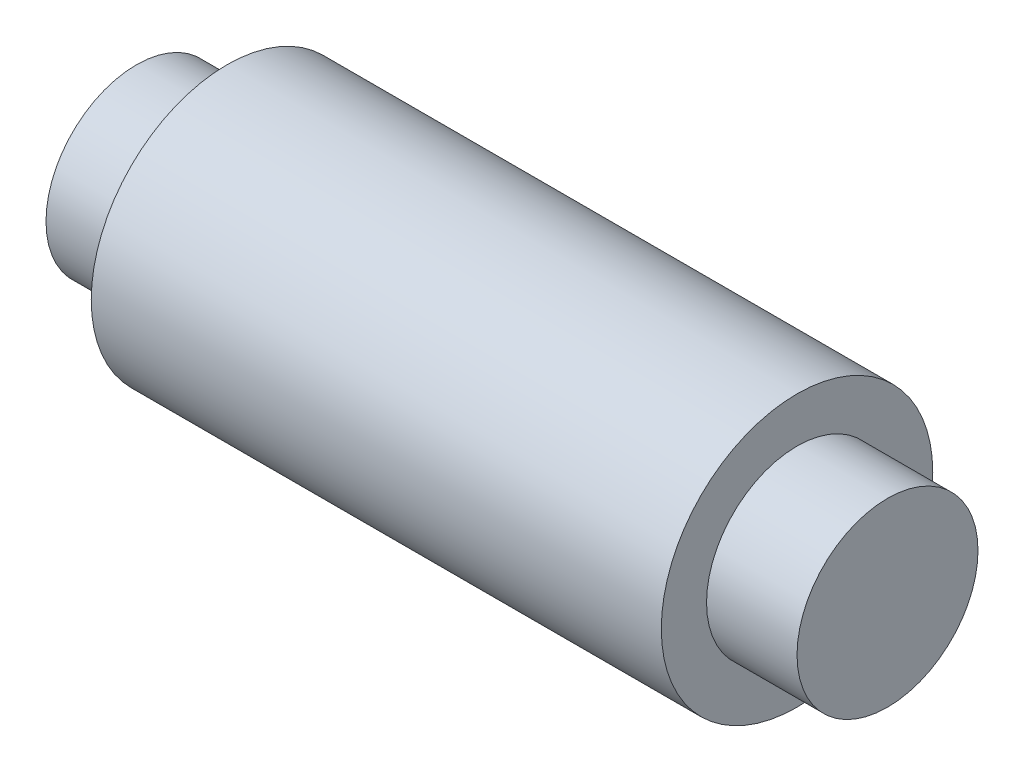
ISO-10303-21;
HEADER;
FILE_DESCRIPTION(('STEP AP214'),'2;1');
FILE_NAME('part.step','',(''),(''),'','','');
FILE_SCHEMA(('AUTOMOTIVE_DESIGN { 1 0 10303 214 1 1 1 1 }'));
ENDSEC;
DATA;
#1=APPLICATION_CONTEXT('core data for automotive mechanical design processes');
#2=APPLICATION_PROTOCOL_DEFINITION('international standard','automotive_design',2000,#1);
#3=PRODUCT_CONTEXT('',#1,'mechanical');
#4=PRODUCT('Part','Part','',(#3));
#5=PRODUCT_RELATED_PRODUCT_CATEGORY('part','',(#4));
#6=PRODUCT_DEFINITION_FORMATION('','',#4);
#7=PRODUCT_DEFINITION_CONTEXT('part definition',#1,'design');
#8=PRODUCT_DEFINITION('design','',#6,#7);
#9=PRODUCT_DEFINITION_SHAPE('','',#8);
#10=(LENGTH_UNIT() NAMED_UNIT(*) SI_UNIT(.MILLI.,.METRE.));
#11=(NAMED_UNIT(*) PLANE_ANGLE_UNIT() SI_UNIT($,.RADIAN.));
#12=(NAMED_UNIT(*) SI_UNIT($,.STERADIAN.) SOLID_ANGLE_UNIT());
#13=UNCERTAINTY_MEASURE_WITH_UNIT(LENGTH_MEASURE(1.E-05),#10,'distance_accuracy_value','');
#14=(GEOMETRIC_REPRESENTATION_CONTEXT(3) GLOBAL_UNCERTAINTY_ASSIGNED_CONTEXT((#13)) GLOBAL_UNIT_ASSIGNED_CONTEXT((#10,
#11,#12)) REPRESENTATION_CONTEXT('',''));
#15=CARTESIAN_POINT('',(0.,0.,0.));
#16=DIRECTION('',(0.,0.,1.));
#17=DIRECTION('',(1.,0.,0.));
#18=AXIS2_PLACEMENT_3D('',#15,#16,#17);
#19=CARTESIAN_POINT('',(0.,0.,0.));
#20=DIRECTION('',(1.,0.,0.));
#21=DIRECTION('',(0.,0.,-1.));
#22=AXIS2_PLACEMENT_3D('',#19,#20,#21);
#23=PLANE('',#22);
#24=CARTESIAN_POINT('',(0.,0.,0.));
#25=DIRECTION('',(-1.,0.,0.));
#26=DIRECTION('',(0.,0.,1.));
#27=AXIS2_PLACEMENT_3D('',#24,#25,#26);
#28=CIRCLE('',#27,10.);
#29=CARTESIAN_POINT('',(0.,0.,10.));
#30=VERTEX_POINT('',#29);
#31=EDGE_CURVE('E10',#30,#30,#28,.T.);
#32=ORIENTED_EDGE('',*,*,#31,.T.);
#33=EDGE_LOOP('',(#32));
#34=FACE_BOUND('',#33,.T.);
#35=ADVANCED_FACE('F26',(#34),#23,.F.);
#36=CARTESIAN_POINT('',(0.,0.,0.));
#37=DIRECTION('',(-1.,0.,0.));
#38=DIRECTION('',(0.,0.,1.));
#39=AXIS2_PLACEMENT_3D('',#36,#37,#38);
#40=CYLINDRICAL_SURFACE('',#39,10.);
#41=ORIENTED_EDGE('',*,*,#31,.F.);
#42=EDGE_LOOP('',(#41));
#43=FACE_BOUND('',#42,.T.);
#44=CARTESIAN_POINT('',(10.,0.,0.));
#45=DIRECTION('',(-1.,0.,0.));
#46=DIRECTION('',(0.,0.,1.));
#47=AXIS2_PLACEMENT_3D('',#44,#45,#46);
#48=CIRCLE('',#47,10.);
#49=CARTESIAN_POINT('',(10.,0.,10.));
#50=VERTEX_POINT('',#49);
#51=EDGE_CURVE('E32',#50,#50,#48,.T.);
#52=ORIENTED_EDGE('',*,*,#51,.T.);
#53=EDGE_LOOP('',(#52));
#54=FACE_BOUND('',#53,.T.);
#55=ADVANCED_FACE('F64',(#43,#54),#40,.T.);
#56=CARTESIAN_POINT('',(10.,10.,0.));
#57=DIRECTION('',(1.,0.,0.));
#58=DIRECTION('',(0.,0.,-1.));
#59=AXIS2_PLACEMENT_3D('',#56,#57,#58);
#60=PLANE('',#59);
#61=ORIENTED_EDGE('',*,*,#51,.F.);
#62=EDGE_LOOP('',(#61));
#63=FACE_BOUND('',#62,.T.);
#64=CARTESIAN_POINT('',(10.,0.,0.));
#65=DIRECTION('',(-1.,0.,0.));
#66=DIRECTION('',(0.,0.,1.));
#67=AXIS2_PLACEMENT_3D('',#64,#65,#66);
#68=CIRCLE('',#67,15.);
#69=CARTESIAN_POINT('',(10.,0.,15.));
#70=VERTEX_POINT('',#69);
#71=EDGE_CURVE('E36',#70,#70,#68,.T.);
#72=ORIENTED_EDGE('',*,*,#71,.T.);
#73=EDGE_LOOP('',(#72));
#74=FACE_BOUND('',#73,.T.);
#75=ADVANCED_FACE('F68',(#63,#74),#60,.F.);
#76=CARTESIAN_POINT('',(0.,0.,0.));
#77=DIRECTION('',(-1.,0.,0.));
#78=DIRECTION('',(0.,0.,1.));
#79=AXIS2_PLACEMENT_3D('',#76,#77,#78);
#80=CYLINDRICAL_SURFACE('',#79,15.);
#81=ORIENTED_EDGE('',*,*,#71,.F.);
#82=EDGE_LOOP('',(#81));
#83=FACE_BOUND('',#82,.T.);
#84=CARTESIAN_POINT('',(73.,0.,0.));
#85=DIRECTION('',(-1.,0.,0.));
#86=DIRECTION('',(0.,0.,1.));
#87=AXIS2_PLACEMENT_3D('',#84,#85,#86);
#88=CIRCLE('',#87,15.);
#89=CARTESIAN_POINT('',(73.,0.,15.));
#90=VERTEX_POINT('',#89);
#91=EDGE_CURVE('E40',#90,#90,#88,.T.);
#92=ORIENTED_EDGE('',*,*,#91,.T.);
#93=EDGE_LOOP('',(#92));
#94=FACE_BOUND('',#93,.T.);
#95=ADVANCED_FACE('F73',(#83,#94),#80,.T.);
#96=CARTESIAN_POINT('',(73.,15.,0.));
#97=DIRECTION('',(-1.,0.,0.));
#98=DIRECTION('',(0.,0.,1.));
#99=AXIS2_PLACEMENT_3D('',#96,#97,#98);
#100=PLANE('',#99);
#101=ORIENTED_EDGE('',*,*,#91,.F.);
#102=EDGE_LOOP('',(#101));
#103=FACE_BOUND('',#102,.T.);
#104=CARTESIAN_POINT('',(73.,0.,0.));
#105=DIRECTION('',(-1.,0.,0.));
#106=DIRECTION('',(0.,0.,1.));
#107=AXIS2_PLACEMENT_3D('',#104,#105,#106);
#108=CIRCLE('',#107,10.);
#109=CARTESIAN_POINT('',(73.,0.,10.));
#110=VERTEX_POINT('',#109);
#111=EDGE_CURVE('E45',#110,#110,#108,.T.);
#112=ORIENTED_EDGE('',*,*,#111,.T.);
#113=EDGE_LOOP('',(#112));
#114=FACE_BOUND('',#113,.T.);
#115=ADVANCED_FACE('F60',(#103,#114),#100,.F.);
#116=CARTESIAN_POINT('',(0.,0.,0.));
#117=DIRECTION('',(-1.,0.,0.));
#118=DIRECTION('',(0.,0.,1.));
#119=AXIS2_PLACEMENT_3D('',#116,#117,#118);
#120=CYLINDRICAL_SURFACE('',#119,10.);
#121=ORIENTED_EDGE('',*,*,#111,.F.);
#122=EDGE_LOOP('',(#121));
#123=FACE_BOUND('',#122,.T.);
#124=CARTESIAN_POINT('',(83.,0.,0.));
#125=DIRECTION('',(-1.,0.,0.));
#126=DIRECTION('',(0.,0.,1.));
#127=AXIS2_PLACEMENT_3D('',#124,#125,#126);
#128=CIRCLE('',#127,10.);
#129=CARTESIAN_POINT('',(83.,0.,10.));
#130=VERTEX_POINT('',#129);
#131=EDGE_CURVE('E48',#130,#130,#128,.T.);
#132=ORIENTED_EDGE('',*,*,#131,.T.);
#133=EDGE_LOOP('',(#132));
#134=FACE_BOUND('',#133,.T.);
#135=ADVANCED_FACE('F52',(#123,#134),#120,.T.);
#136=CARTESIAN_POINT('',(83.,10.,0.));
#137=DIRECTION('',(-1.,0.,0.));
#138=DIRECTION('',(0.,0.,1.));
#139=AXIS2_PLACEMENT_3D('',#136,#137,#138);
#140=PLANE('',#139);
#141=ORIENTED_EDGE('',*,*,#131,.F.);
#142=EDGE_LOOP('',(#141));
#143=FACE_BOUND('',#142,.T.);
#144=ADVANCED_FACE('F54',(#143),#140,.F.);
#145=CLOSED_SHELL('',(#35,#55,#75,#95,#115,#135,#144));
#146=MANIFOLD_SOLID_BREP('B2',#145);
#147=ADVANCED_BREP_SHAPE_REPRESENTATION('',(#18,#146),#14);
#148=SHAPE_DEFINITION_REPRESENTATION(#9,#147);
ENDSEC;
END-ISO-10303-21;
